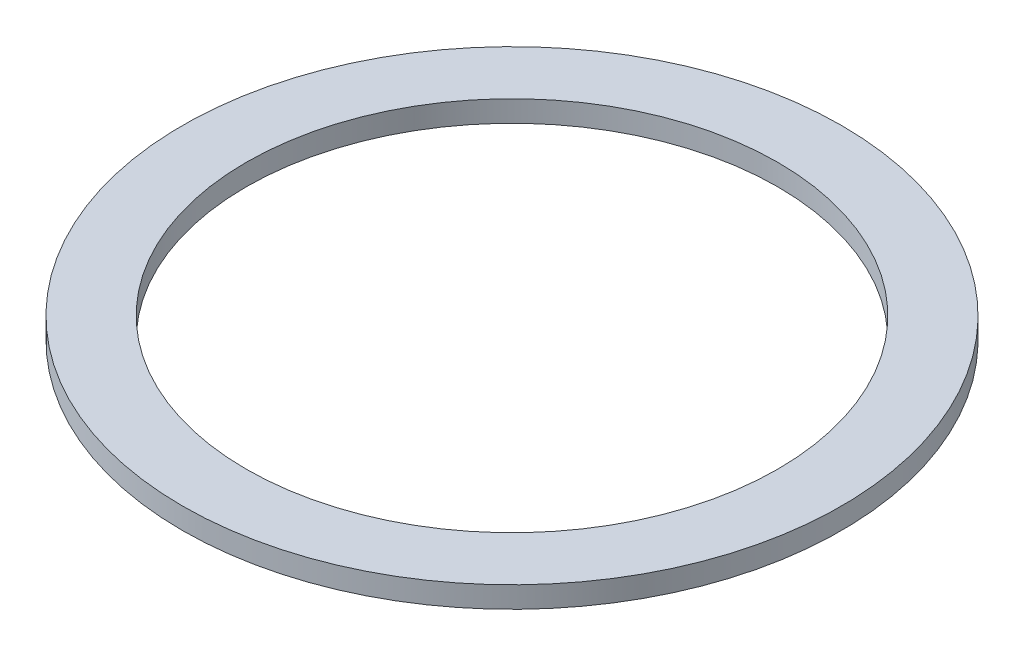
ISO-10303-21;
HEADER;
FILE_DESCRIPTION(('STEP AP214'),'2;1');
FILE_NAME('part.step','',(''),(''),'','','');
FILE_SCHEMA(('AUTOMOTIVE_DESIGN { 1 0 10303 214 1 1 1 1 }'));
ENDSEC;
DATA;
#1=APPLICATION_CONTEXT('core data for automotive mechanical design processes');
#2=APPLICATION_PROTOCOL_DEFINITION('international standard','automotive_design',2000,#1);
#3=PRODUCT_CONTEXT('',#1,'mechanical');
#4=PRODUCT('Part','Part','',(#3));
#5=PRODUCT_RELATED_PRODUCT_CATEGORY('part','',(#4));
#6=PRODUCT_DEFINITION_FORMATION('','',#4);
#7=PRODUCT_DEFINITION_CONTEXT('part definition',#1,'design');
#8=PRODUCT_DEFINITION('design','',#6,#7);
#9=PRODUCT_DEFINITION_SHAPE('','',#8);
#10=(LENGTH_UNIT() NAMED_UNIT(*) SI_UNIT(.MILLI.,.METRE.));
#11=(NAMED_UNIT(*) PLANE_ANGLE_UNIT() SI_UNIT($,.RADIAN.));
#12=(NAMED_UNIT(*) SI_UNIT($,.STERADIAN.) SOLID_ANGLE_UNIT());
#13=UNCERTAINTY_MEASURE_WITH_UNIT(LENGTH_MEASURE(1.E-05),#10,'distance_accuracy_value','');
#14=(GEOMETRIC_REPRESENTATION_CONTEXT(3) GLOBAL_UNCERTAINTY_ASSIGNED_CONTEXT((#13)) GLOBAL_UNIT_ASSIGNED_CONTEXT((#10,
#11,#12)) REPRESENTATION_CONTEXT('',''));
#15=CARTESIAN_POINT('',(0.,0.,0.));
#16=DIRECTION('',(0.,0.,1.));
#17=DIRECTION('',(1.,0.,0.));
#18=AXIS2_PLACEMENT_3D('',#15,#16,#17);
#19=CARTESIAN_POINT('',(0.,0.8,0.));
#20=DIRECTION('',(0.,1.,0.));
#21=DIRECTION('',(0.,0.,1.));
#22=AXIS2_PLACEMENT_3D('',#19,#20,#21);
#23=PLANE('',#22);
#24=CARTESIAN_POINT('',(0.,0.8,0.));
#25=DIRECTION('',(0.,1.,0.));
#26=DIRECTION('',(0.,0.,1.));
#27=AXIS2_PLACEMENT_3D('',#24,#25,#26);
#28=CIRCLE('',#27,12.4);
#29=CARTESIAN_POINT('',(0.,0.8,12.4));
#30=VERTEX_POINT('',#29);
#31=EDGE_CURVE('E10',#30,#30,#28,.T.);
#32=ORIENTED_EDGE('',*,*,#31,.T.);
#33=EDGE_LOOP('',(#32));
#34=FACE_BOUND('',#33,.T.);
#35=CARTESIAN_POINT('',(0.,0.8,0.));
#36=DIRECTION('',(0.,1.,0.));
#37=DIRECTION('',(0.,0.,1.));
#38=AXIS2_PLACEMENT_3D('',#35,#36,#37);
#39=CIRCLE('',#38,10.);
#40=CARTESIAN_POINT('',(0.,0.8,10.));
#41=VERTEX_POINT('',#40);
#42=EDGE_CURVE('E46',#41,#41,#39,.T.);
#43=ORIENTED_EDGE('',*,*,#42,.F.);
#44=EDGE_LOOP('',(#43));
#45=FACE_BOUND('',#44,.T.);
#46=ADVANCED_FACE('F35',(#34,#45),#23,.T.);
#47=CARTESIAN_POINT('',(0.,0.,0.));
#48=DIRECTION('',(0.,1.,0.));
#49=DIRECTION('',(0.,0.,1.));
#50=AXIS2_PLACEMENT_3D('',#47,#48,#49);
#51=PLANE('',#50);
#52=CARTESIAN_POINT('',(0.,0.,0.));
#53=DIRECTION('',(0.,1.,0.));
#54=DIRECTION('',(0.,0.,1.));
#55=AXIS2_PLACEMENT_3D('',#52,#53,#54);
#56=CIRCLE('',#55,12.4);
#57=CARTESIAN_POINT('',(0.,0.,12.4));
#58=VERTEX_POINT('',#57);
#59=EDGE_CURVE('E39',#58,#58,#56,.T.);
#60=ORIENTED_EDGE('',*,*,#59,.F.);
#61=EDGE_LOOP('',(#60));
#62=FACE_BOUND('',#61,.T.);
#63=CARTESIAN_POINT('',(0.,0.,0.));
#64=DIRECTION('',(0.,1.,0.));
#65=DIRECTION('',(0.,0.,1.));
#66=AXIS2_PLACEMENT_3D('',#63,#64,#65);
#67=CIRCLE('',#66,10.);
#68=CARTESIAN_POINT('',(0.,0.,10.));
#69=VERTEX_POINT('',#68);
#70=EDGE_CURVE('E48',#69,#69,#67,.T.);
#71=ORIENTED_EDGE('',*,*,#70,.T.);
#72=EDGE_LOOP('',(#71));
#73=FACE_BOUND('',#72,.T.);
#74=ADVANCED_FACE('F58',(#62,#73),#51,.F.);
#75=CARTESIAN_POINT('',(0.,0.8,0.));
#76=DIRECTION('',(0.,-1.,0.));
#77=DIRECTION('',(0.,0.,-1.));
#78=AXIS2_PLACEMENT_3D('',#75,#76,#77);
#79=CYLINDRICAL_SURFACE('',#78,12.4);
#80=ORIENTED_EDGE('',*,*,#31,.F.);
#81=EDGE_LOOP('',(#80));
#82=FACE_BOUND('',#81,.T.);
#83=ORIENTED_EDGE('',*,*,#59,.T.);
#84=EDGE_LOOP('',(#83));
#85=FACE_BOUND('',#84,.T.);
#86=ADVANCED_FACE('F37',(#82,#85),#79,.T.);
#87=CARTESIAN_POINT('',(0.,0.8,0.));
#88=DIRECTION('',(0.,-1.,0.));
#89=DIRECTION('',(0.,0.,-1.));
#90=AXIS2_PLACEMENT_3D('',#87,#88,#89);
#91=CYLINDRICAL_SURFACE('',#90,10.);
#92=ORIENTED_EDGE('',*,*,#42,.T.);
#93=EDGE_LOOP('',(#92));
#94=FACE_BOUND('',#93,.T.);
#95=ORIENTED_EDGE('',*,*,#70,.F.);
#96=EDGE_LOOP('',(#95));
#97=FACE_BOUND('',#96,.T.);
#98=ADVANCED_FACE('F54',(#94,#97),#91,.F.);
#99=CLOSED_SHELL('',(#46,#74,#86,#98));
#100=MANIFOLD_SOLID_BREP('B2',#99);
#101=ADVANCED_BREP_SHAPE_REPRESENTATION('',(#18,#100),#14);
#102=SHAPE_DEFINITION_REPRESENTATION(#9,#101);
ENDSEC;
END-ISO-10303-21;
